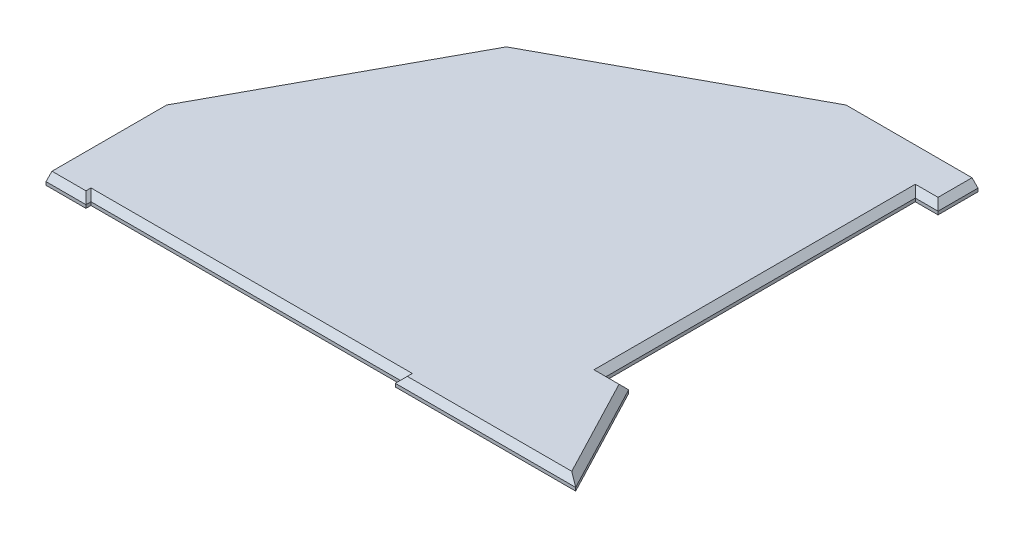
from build123d import *

# Parameters (mm, degrees)
BOSS_EXTRUDE2_DEPTH = 19.05
CHAMFER1_SIZE       = 15


with BuildPart() as part:
    # Sketch2 → Boss-Extrude2 (new, symmetric)
    with BuildSketch(Plane(origin=(0, 0, 0), x_dir=(-1, 0, 0), z_dir=(0, 1, 0))):
        Polygon((604.715914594, 547.712647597), (604.715914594, 560.237647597), (704.715914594, 560.237647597), (704.715914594, 258.331543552), (405.744758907, -292.581496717), (-145.168281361, -591.552652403), (-475.296585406, -591.552652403), (-475.296585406, -491.552652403), (-418.496585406, -491.552652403), (-418.496585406, 282.447347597), (-475.296585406, 282.447347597), (-620.484085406, 560.237647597), (-169.284085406, 560.237647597), (-169.284085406, 547.712647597), align=None)
    extrude(amount=BOSS_EXTRUDE2_DEPTH, both=True)

    # Chamfer1
    chamfer1_edges = [part.edges().sort_by_distance(p)[0] for p in [
        (475.296585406, -19.05, -541.552652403),
        (446.896585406, -19.05, -491.552652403),
        (418.496585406, -19.05, -104.552652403),
        (446.896585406, -19.05, 282.447347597),
        (547.890335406, -19.05, 421.342497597),
        (394.884085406, -19.05, 560.237647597),
        (169.284085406, -19.05, 553.975147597),
        (-654.715914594, 19.05, 560.237647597),
        (-217.715914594, -19.05, 547.712647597),
        (-604.715914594, -19.05, 553.975147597),
        (-654.715914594, -19.05, 560.237647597),
        (-604.715914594, 19.05, 553.975147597),
        (-217.715914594, 19.05, 547.712647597),
        (169.284085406, 19.05, 553.975147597),
        (394.884085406, 19.05, 560.237647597),
        (547.890335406, 19.05, 421.342497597),
        (446.896585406, 19.05, 282.447347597),
        (418.496585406, 19.05, -104.552652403),
        (446.896585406, 19.05, -491.552652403),
        (475.296585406, 19.05, -541.552652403),
    ]]
    chamfer(chamfer1_edges, length=CHAMFER1_SIZE)


solid = part.part
